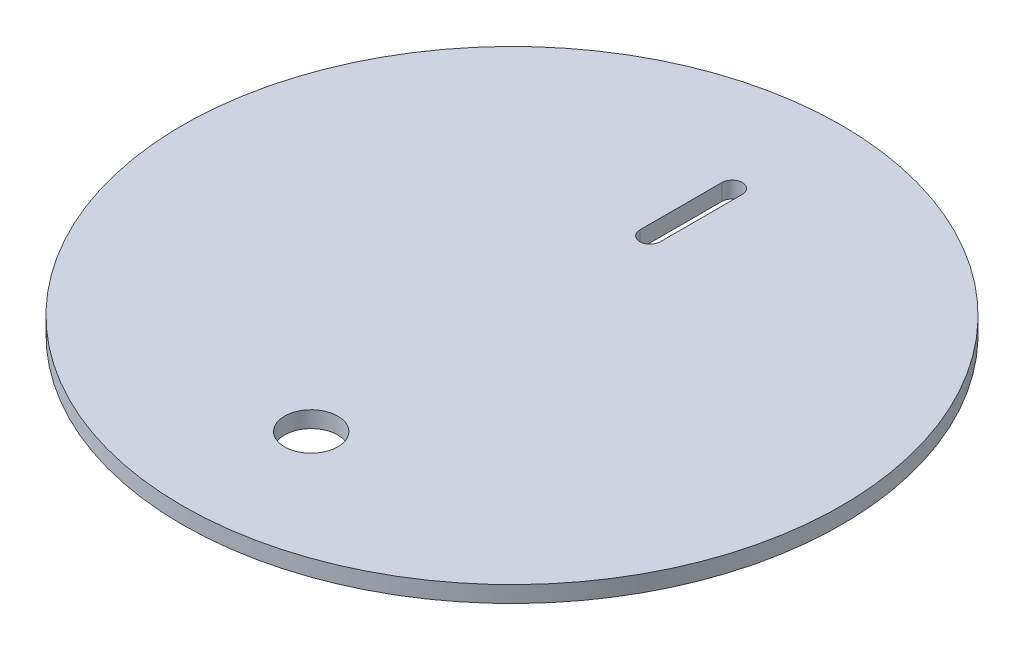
from build123d import *

# Parameters (mm, degrees)
SKETCH1_R           = 80.4
BOSS_EXTRUDE1_DEPTH = 4
SKETCH4_R           = 6.5
CUT_EXTRUDE2_DEPTH  = 114.773107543


with BuildPart() as part:
    # Sketch1 → Boss-Extrude1 (new body)
    with BuildSketch(Plane(origin=(0, 0, 0), x_dir=(1, 0, 0), z_dir=(0, 1, 0))):
        with Locations(Location((0, 0, 0), (0, 0, 270))):
            Circle(SKETCH1_R)
    extrude(amount=BOSS_EXTRUDE1_DEPTH)

    # Sketch4 → Cut-Extrude2 (cut, through all)
    with BuildSketch(Plane.XZ):
        with Locations(Location((0, 48.986018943, 0), (0, 0, 270))):
            Circle(SKETCH4_R)
        with BuildLine():
            Line((2.5, -33.7007745), (2.5, -53.7007745))
            ThreePointArc((2.5, -53.7007745), (0, -56.2007745), (-2.5, -53.7007745))
            Line((-2.5, -53.7007745), (-2.5, -33.7007745))
            ThreePointArc((-2.5, -33.7007745), (0, -31.2007745), (2.5, -33.7007745))
        make_face()
    extrude(amount=-CUT_EXTRUDE2_DEPTH, mode=Mode.SUBTRACT)


solid = part.part
